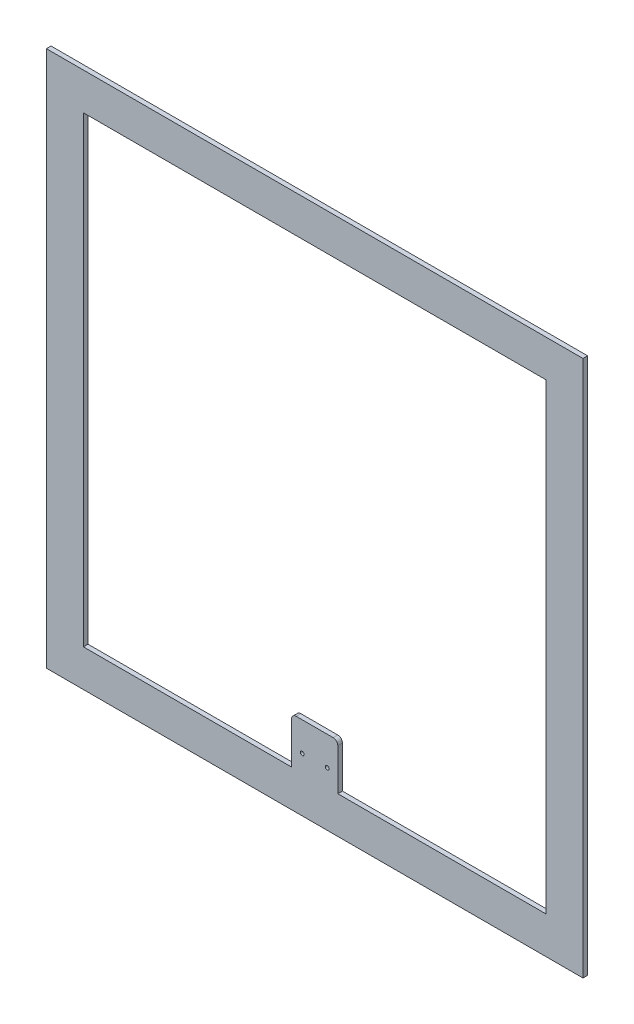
from build123d import *

# Parameters (mm, degrees)
ESQUISSE1_W             = 580
ESQUISSE1_H             = 580
BOSS_EXTRU_1_DEPTH      = 5
ENL_V_MAT_EXTRU_1_REACH = 412.152
ESQUISSE2_R             = 2
CONG_1_R                = 5


with BuildPart() as part:
    # Esquisse1 → Boss.-Extru.1 (new body)
    with BuildSketch(Plane.XY):
        Rectangle(ESQUISSE1_W, ESQUISSE1_H)
        Polygon((-250, 250), (250, 250), (250, -250), (25, -250), (25, -200), (-25, -200), (-25, -250), (-250, -250), align=None, mode=Mode.SUBTRACT)
    extrude(amount=BOSS_EXTRU_1_DEPTH)

    # Esquisse2 → Enl_v. mat.-Extru.1 (cut, up to next)
    with BuildSketch(Plane.XY.offset(5), mode=Mode.PRIVATE) as enl_v_mat_extru_1_sk1:
        with Locations((-13.5, -231.5)):
            Circle(ESQUISSE2_R)
    enl_v_mat_extru_1_tool1 = extrude(enl_v_mat_extru_1_sk1.sketch, amount=-ENL_V_MAT_EXTRU_1_REACH, mode=Mode.PRIVATE) & part.part
    # Esquisse2 → Enl_v. mat.-Extru.1 (cut, up to next)
    with BuildSketch(Plane.XY.offset(5), mode=Mode.PRIVATE) as enl_v_mat_extru_1_sk2:
        with Locations((13.5, -231.5)):
            Circle(ESQUISSE2_R)
    enl_v_mat_extru_1_tool2 = extrude(enl_v_mat_extru_1_sk2.sketch, amount=-ENL_V_MAT_EXTRU_1_REACH, mode=Mode.PRIVATE) & part.part
    add(enl_v_mat_extru_1_tool1.solids().sort_by_distance((-13.5, -231.5, 5))[0], mode=Mode.SUBTRACT)
    add(enl_v_mat_extru_1_tool2.solids().sort_by_distance((13.5, -231.5, 5))[0], mode=Mode.SUBTRACT)

    # Cong_1
    cong_1_edges = [part.edges().sort_by_distance(p)[0] for p in [
        (-25, -200, 2.5),
        (25, -200, 2.5),
    ]]
    fillet(cong_1_edges, radius=CONG_1_R)


solid = part.part
